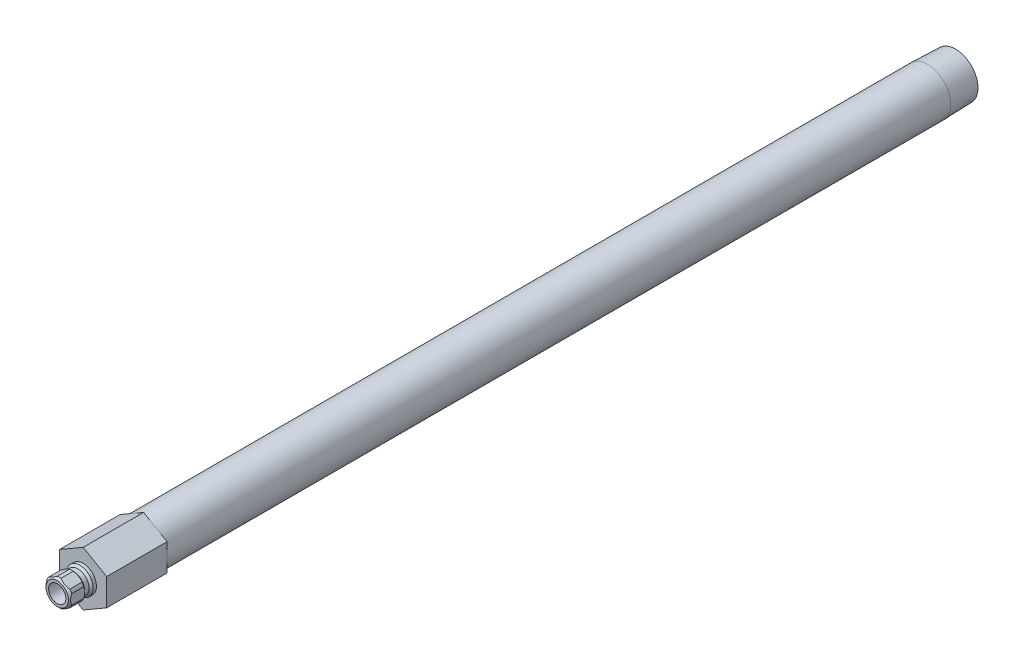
from build123d import *

# Parameters (mm, degrees)
SKETCH2_R           = 3.175
BOSS_EXTRUDE1_DEPTH = 22.225
CUT_EXTRUDE1_START  = 3.556
SKETCH3_OUTSIDE_W   = 85.522
SKETCH3_OUTSIDE_H   = 88.194
CUT_EXTRUDE1_DEPTH  = 318.390221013


with BuildPart() as part:
    # Sketch1 → Revolve1 (revolve)
    with BuildSketch(Plane(origin=(0, 0, 0), x_dir=(0, 0, -1), z_dir=(1, 0, 0))):
        Polygon((-9.525, 3.175), (-9.525, 4.1275), (-8.763, 4.8895), (-4.318, 4.8895), (-3.556, 4.1275), (-1.9685, 4.1275), (-1.2065, 4.8895), (0, 4.8895), (0, 8.5725), (310.3372, 8.5725), (320.675, 8.249445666), (320.675, 6.2611), (22.225, 6.2611), (22.225, 3.175), align=None)
    revolve(axis=Axis((0, 0, 0), (0, 0, 1)))

    # Sketch2 → Boss-Extrude1 (add)
    with BuildSketch(Plane.XY):
        Polygon((-8.636, 4.985996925), (-8.636, -4.985996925), (0, -9.971993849), (8.636, -4.985996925), (8.636, 4.985996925), (0, 9.971993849), align=None)
        with Locations(Location((0, 0, 0), (0, 0, 90))):
            Circle(SKETCH2_R, mode=Mode.SUBTRACT)
    extrude(amount=-BOSS_EXTRUDE1_DEPTH)

    # Sketch3 outside → Cut-Extrude1 (cut, through all)
    with BuildSketch(Plane.XY.offset(CUT_EXTRUDE1_START)):
        Rectangle(SKETCH3_OUTSIDE_W, SKETCH3_OUTSIDE_H)
        Polygon((4.5212, 2.610316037), (0, 5.220632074), (-4.5212, 2.610316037), (-4.5212, -2.610316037), (0, -5.220632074), (4.5212, -2.610316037), align=None, mode=Mode.SUBTRACT)
    extrude(amount=CUT_EXTRUDE1_DEPTH, mode=Mode.SUBTRACT)


solid = part.part
